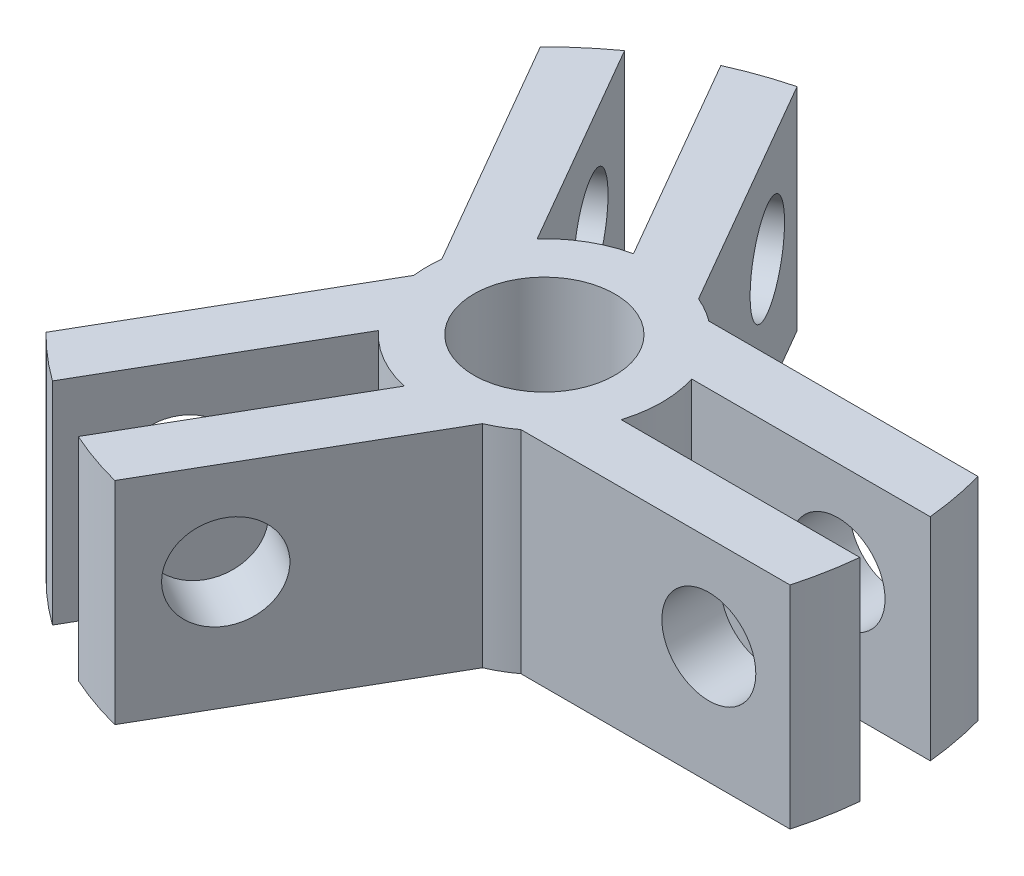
ISO-10303-21;
HEADER;
FILE_DESCRIPTION(('STEP AP214'),'2;1');
FILE_NAME('part.step','',(''),(''),'','','');
FILE_SCHEMA(('AUTOMOTIVE_DESIGN { 1 0 10303 214 1 1 1 1 }'));
ENDSEC;
DATA;
#1=APPLICATION_CONTEXT('core data for automotive mechanical design processes');
#2=APPLICATION_PROTOCOL_DEFINITION('international standard','automotive_design',2000,#1);
#3=PRODUCT_CONTEXT('',#1,'mechanical');
#4=PRODUCT('Part','Part','',(#3));
#5=PRODUCT_RELATED_PRODUCT_CATEGORY('part','',(#4));
#6=PRODUCT_DEFINITION_FORMATION('','',#4);
#7=PRODUCT_DEFINITION_CONTEXT('part definition',#1,'design');
#8=PRODUCT_DEFINITION('design','',#6,#7);
#9=PRODUCT_DEFINITION_SHAPE('','',#8);
#10=(LENGTH_UNIT() NAMED_UNIT(*) SI_UNIT(.MILLI.,.METRE.));
#11=(NAMED_UNIT(*) PLANE_ANGLE_UNIT() SI_UNIT($,.RADIAN.));
#12=(NAMED_UNIT(*) SI_UNIT($,.STERADIAN.) SOLID_ANGLE_UNIT());
#13=UNCERTAINTY_MEASURE_WITH_UNIT(LENGTH_MEASURE(1.E-05),#10,'distance_accuracy_value','');
#14=(GEOMETRIC_REPRESENTATION_CONTEXT(3) GLOBAL_UNCERTAINTY_ASSIGNED_CONTEXT((#13)) GLOBAL_UNIT_ASSIGNED_CONTEXT((#10,
#11,#12)) REPRESENTATION_CONTEXT('',''));
#15=CARTESIAN_POINT('',(0.,0.,0.));
#16=DIRECTION('',(0.,0.,1.));
#17=DIRECTION('',(1.,0.,0.));
#18=AXIS2_PLACEMENT_3D('',#15,#16,#17);
#19=CARTESIAN_POINT('',(0.,18.,0.));
#20=DIRECTION('',(0.,-1.,0.));
#21=DIRECTION('',(0.,0.,-1.));
#22=AXIS2_PLACEMENT_3D('',#19,#20,#21);
#23=CYLINDRICAL_SURFACE('',#22,30.);
#24=CARTESIAN_POINT('',(0.,18.,0.));
#25=DIRECTION('',(0.,1.,0.));
#26=DIRECTION('',(0.,0.,1.));
#27=AXIS2_PLACEMENT_3D('',#24,#25,#26);
#28=CIRCLE('',#27,30.);
#29=CARTESIAN_POINT('',(-7.52862906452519,18.,-29.0399680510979));
#30=VERTEX_POINT('',#29);
#31=CARTESIAN_POINT('',(-12.3267353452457,18.,-27.3505319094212));
#32=VERTEX_POINT('',#31);
#33=EDGE_CURVE('E46',#30,#32,#28,.T.);
#34=ORIENTED_EDGE('',*,*,#33,.F.);
#35=DIRECTION('',(0.,1.,0.));
#36=VECTOR('',#35,1.);
#37=CARTESIAN_POINT('',(-7.52862906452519,0.,-29.0399680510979));
#38=LINE('',#37,#36);
#39=CARTESIAN_POINT('',(-7.52862906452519,0.,-29.0399680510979));
#40=VERTEX_POINT('',#39);
#41=EDGE_CURVE('E236',#40,#30,#38,.T.);
#42=ORIENTED_EDGE('',*,*,#41,.F.);
#43=CARTESIAN_POINT('',(0.,0.,0.));
#44=DIRECTION('',(0.,1.,0.));
#45=DIRECTION('',(0.,0.,1.));
#46=AXIS2_PLACEMENT_3D('',#43,#44,#45);
#47=CIRCLE('',#46,30.);
#48=CARTESIAN_POINT('',(-12.3267353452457,0.,-27.3505319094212));
#49=VERTEX_POINT('',#48);
#50=EDGE_CURVE('E377',#40,#49,#47,.T.);
#51=ORIENTED_EDGE('',*,*,#50,.T.);
#52=DIRECTION('',(0.,1.,0.));
#53=VECTOR('',#52,1.);
#54=CARTESIAN_POINT('',(-12.3267353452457,0.,-27.3505319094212));
#55=LINE('',#54,#53);
#56=EDGE_CURVE('E306',#49,#32,#55,.T.);
#57=ORIENTED_EDGE('',*,*,#56,.T.);
#58=EDGE_LOOP('',(#34,#42,#51,#57));
#59=FACE_BOUND('',#58,.T.);
#60=ADVANCED_FACE('F37',(#59),#23,.T.);
#61=CARTESIAN_POINT('',(-21.3850355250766,18.,21.0399680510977));
#62=VERTEX_POINT('',#61);
#63=CARTESIAN_POINT('',(-17.5228877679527,18.,24.3505319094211));
#64=VERTEX_POINT('',#63);
#65=EDGE_CURVE('E484',#62,#64,#28,.T.);
#66=ORIENTED_EDGE('',*,*,#65,.F.);
#67=DIRECTION('',(0.,1.,0.));
#68=VECTOR('',#67,1.);
#69=CARTESIAN_POINT('',(-21.3850355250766,0.,21.0399680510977));
#70=LINE('',#69,#68);
#71=CARTESIAN_POINT('',(-21.3850355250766,0.,21.0399680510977));
#72=VERTEX_POINT('',#71);
#73=EDGE_CURVE('E258',#72,#62,#70,.T.);
#74=ORIENTED_EDGE('',*,*,#73,.F.);
#75=CARTESIAN_POINT('',(-17.5228877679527,0.,24.3505319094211));
#76=VERTEX_POINT('',#75);
#77=EDGE_CURVE('E461',#72,#76,#47,.T.);
#78=ORIENTED_EDGE('',*,*,#77,.T.);
#79=DIRECTION('',(0.,1.,0.));
#80=VECTOR('',#79,1.);
#81=CARTESIAN_POINT('',(-17.5228877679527,0.,24.3505319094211));
#82=LINE('',#81,#80);
#83=EDGE_CURVE('E333',#76,#64,#82,.T.);
#84=ORIENTED_EDGE('',*,*,#83,.T.);
#85=EDGE_LOOP('',(#66,#74,#78,#84));
#86=FACE_BOUND('',#85,.T.);
#87=ADVANCED_FACE('F437',(#86),#23,.T.);
#88=CARTESIAN_POINT('',(28.9136645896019,18.,7.99999999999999));
#89=VERTEX_POINT('',#88);
#90=CARTESIAN_POINT('',(29.8496231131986,18.,2.99999999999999));
#91=VERTEX_POINT('',#90);
#92=EDGE_CURVE('E376',#89,#91,#28,.T.);
#93=ORIENTED_EDGE('',*,*,#92,.F.);
#94=DIRECTION('',(0.,1.,0.));
#95=VECTOR('',#94,1.);
#96=CARTESIAN_POINT('',(28.9136645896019,0.,7.99999999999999));
#97=LINE('',#96,#95);
#98=CARTESIAN_POINT('',(28.9136645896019,0.,7.99999999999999));
#99=VERTEX_POINT('',#98);
#100=EDGE_CURVE('E282',#99,#89,#97,.T.);
#101=ORIENTED_EDGE('',*,*,#100,.F.);
#102=CARTESIAN_POINT('',(29.8496231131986,0.,2.99999999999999));
#103=VERTEX_POINT('',#102);
#104=EDGE_CURVE('E374',#99,#103,#47,.T.);
#105=ORIENTED_EDGE('',*,*,#104,.T.);
#106=DIRECTION('',(0.,1.,0.));
#107=VECTOR('',#106,1.);
#108=CARTESIAN_POINT('',(29.8496231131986,0.,2.99999999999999));
#109=LINE('',#108,#107);
#110=EDGE_CURVE('E360',#103,#91,#109,.T.);
#111=ORIENTED_EDGE('',*,*,#110,.T.);
#112=EDGE_LOOP('',(#93,#101,#105,#111));
#113=FACE_BOUND('',#112,.T.);
#114=ADVANCED_FACE('F442',(#113),#23,.T.);
#115=CARTESIAN_POINT('',(29.8496231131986,0.,-3.00000000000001));
#116=VERTEX_POINT('',#115);
#117=CARTESIAN_POINT('',(28.913664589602,0.,-7.99999999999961));
#118=VERTEX_POINT('',#117);
#119=EDGE_CURVE('E375',#116,#118,#47,.T.);
#120=ORIENTED_EDGE('',*,*,#119,.T.);
#121=DIRECTION('',(0.,1.,0.));
#122=VECTOR('',#121,1.);
#123=CARTESIAN_POINT('',(28.913664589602,0.,-7.99999999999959));
#124=LINE('',#123,#122);
#125=CARTESIAN_POINT('',(28.913664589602,18.,-7.99999999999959));
#126=VERTEX_POINT('',#125);
#127=EDGE_CURVE('E55',#118,#126,#124,.T.);
#128=ORIENTED_EDGE('',*,*,#127,.T.);
#129=CARTESIAN_POINT('',(29.8496231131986,18.,-3.00000000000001));
#130=VERTEX_POINT('',#129);
#131=EDGE_CURVE('E11',#130,#126,#28,.T.);
#132=ORIENTED_EDGE('',*,*,#131,.F.);
#133=DIRECTION('',(0.,1.,0.));
#134=VECTOR('',#133,1.);
#135=CARTESIAN_POINT('',(29.8496231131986,0.,-3.00000000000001));
#136=LINE('',#135,#134);
#137=EDGE_CURVE('E352',#116,#130,#136,.T.);
#138=ORIENTED_EDGE('',*,*,#137,.F.);
#139=EDGE_LOOP('',(#120,#128,#132,#138));
#140=FACE_BOUND('',#139,.T.);
#141=ADVANCED_FACE('F454',(#140),#23,.T.);
#142=CARTESIAN_POINT('',(-17.5228877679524,0.,-24.3505319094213));
#143=VERTEX_POINT('',#142);
#144=CARTESIAN_POINT('',(-21.3850355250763,0.,-21.039968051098));
#145=VERTEX_POINT('',#144);
#146=EDGE_CURVE('E462',#143,#145,#47,.T.);
#147=ORIENTED_EDGE('',*,*,#146,.T.);
#148=DIRECTION('',(0.,1.,0.));
#149=VECTOR('',#148,1.);
#150=CARTESIAN_POINT('',(-21.3850355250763,0.,-21.039968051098));
#151=LINE('',#150,#149);
#152=CARTESIAN_POINT('',(-21.3850355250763,18.,-21.039968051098));
#153=VERTEX_POINT('',#152);
#154=EDGE_CURVE('E63',#145,#153,#151,.T.);
#155=ORIENTED_EDGE('',*,*,#154,.T.);
#156=CARTESIAN_POINT('',(-17.5228877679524,18.,-24.3505319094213));
#157=VERTEX_POINT('',#156);
#158=EDGE_CURVE('E483',#157,#153,#28,.T.);
#159=ORIENTED_EDGE('',*,*,#158,.F.);
#160=DIRECTION('',(0.,1.,0.));
#161=VECTOR('',#160,1.);
#162=CARTESIAN_POINT('',(-17.5228877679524,0.,-24.3505319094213));
#163=LINE('',#162,#161);
#164=EDGE_CURVE('E298',#143,#157,#163,.T.);
#165=ORIENTED_EDGE('',*,*,#164,.F.);
#166=EDGE_LOOP('',(#147,#155,#159,#165));
#167=FACE_BOUND('',#166,.T.);
#168=ADVANCED_FACE('F447',(#167),#23,.T.);
#169=CARTESIAN_POINT('',(-12.3267353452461,0.,27.3505319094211));
#170=VERTEX_POINT('',#169);
#171=CARTESIAN_POINT('',(-7.52862906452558,0.,29.0399680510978));
#172=VERTEX_POINT('',#171);
#173=EDGE_CURVE('E378',#170,#172,#47,.T.);
#174=ORIENTED_EDGE('',*,*,#173,.T.);
#175=DIRECTION('',(0.,1.,0.));
#176=VECTOR('',#175,1.);
#177=CARTESIAN_POINT('',(-7.52862906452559,0.,29.0399680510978));
#178=LINE('',#177,#176);
#179=CARTESIAN_POINT('',(-7.52862906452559,18.,29.0399680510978));
#180=VERTEX_POINT('',#179);
#181=EDGE_CURVE('E284',#172,#180,#178,.T.);
#182=ORIENTED_EDGE('',*,*,#181,.T.);
#183=CARTESIAN_POINT('',(-12.3267353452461,18.,27.3505319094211));
#184=VERTEX_POINT('',#183);
#185=EDGE_CURVE('E48',#184,#180,#28,.T.);
#186=ORIENTED_EDGE('',*,*,#185,.F.);
#187=DIRECTION('',(0.,1.,0.));
#188=VECTOR('',#187,1.);
#189=CARTESIAN_POINT('',(-12.3267353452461,0.,27.3505319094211));
#190=LINE('',#189,#188);
#191=EDGE_CURVE('E325',#170,#184,#190,.T.);
#192=ORIENTED_EDGE('',*,*,#191,.F.);
#193=EDGE_LOOP('',(#174,#182,#186,#192));
#194=FACE_BOUND('',#193,.T.);
#195=ADVANCED_FACE('F39',(#194),#23,.T.);
#196=CARTESIAN_POINT('',(0.,18.,0.));
#197=DIRECTION('',(0.,1.,0.));
#198=DIRECTION('',(0.,0.,1.));
#199=AXIS2_PLACEMENT_3D('',#196,#197,#198);
#200=PLANE('',#199);
#201=DIRECTION('',(0.499999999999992,0.,0.866025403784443));
#202=VECTOR('',#201,1.);
#203=CARTESIAN_POINT('',(3.92820323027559,18.,-9.19615242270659));
#204=LINE('',#203,#202);
#205=CARTESIAN_POINT('',(3.92820323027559,18.,-9.19615242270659));
#206=VERTEX_POINT('',#205);
#207=EDGE_CURVE('E221',#30,#206,#204,.T.);
#208=ORIENTED_EDGE('',*,*,#207,.F.);
#209=ORIENTED_EDGE('',*,*,#33,.T.);
#210=DIRECTION('',(-0.499999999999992,0.,-0.866025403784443));
#211=VECTOR('',#210,1.);
#212=CARTESIAN_POINT('',(-2.17161979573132,18.,-9.76135582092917));
#213=LINE('',#212,#211);
#214=CARTESIAN_POINT('',(-2.17161979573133,18.,-9.76135582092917));
#215=VERTEX_POINT('',#214);
#216=EDGE_CURVE('E292',#215,#32,#213,.T.);
#217=ORIENTED_EDGE('',*,*,#216,.F.);
#218=CARTESIAN_POINT('',(0.,18.,0.));
#219=DIRECTION('',(0.,-1.,0.));
#220=DIRECTION('',(-0.866025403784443,0.,0.499999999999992));
#221=AXIS2_PLACEMENT_3D('',#218,#219,#220);
#222=CIRCLE('',#221,10.);
#223=CARTESIAN_POINT('',(-7.36777221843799,18.,-6.76135582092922));
#224=VERTEX_POINT('',#223);
#225=EDGE_CURVE('E301',#224,#215,#222,.T.);
#226=ORIENTED_EDGE('',*,*,#225,.F.);
#227=DIRECTION('',(0.499999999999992,0.,0.866025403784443));
#228=VECTOR('',#227,1.);
#229=CARTESIAN_POINT('',(-17.5228877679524,18.,-24.3505319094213));
#230=LINE('',#229,#228);
#231=EDGE_CURVE('E281',#157,#224,#230,.T.);
#232=ORIENTED_EDGE('',*,*,#231,.F.);
#233=ORIENTED_EDGE('',*,*,#158,.T.);
#234=DIRECTION('',(-0.499999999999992,0.,-0.866025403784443));
#235=VECTOR('',#234,1.);
#236=CARTESIAN_POINT('',(-21.3850355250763,18.,-21.039968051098));
#237=LINE('',#236,#235);
#238=CARTESIAN_POINT('',(-9.9282032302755,18.,-1.19615242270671));
#239=VERTEX_POINT('',#238);
#240=EDGE_CURVE('E251',#239,#153,#237,.T.);
#241=ORIENTED_EDGE('',*,*,#240,.F.);
#242=CARTESIAN_POINT('',(0.,18.,0.));
#243=DIRECTION('',(0.,-1.,0.));
#244=DIRECTION('',(-0.866025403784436,0.,-0.500000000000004));
#245=AXIS2_PLACEMENT_3D('',#242,#243,#244);
#246=CIRCLE('',#245,10.);
#247=CARTESIAN_POINT('',(-9.92820323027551,18.,1.19615242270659));
#248=VERTEX_POINT('',#247);
#249=EDGE_CURVE('E235',#248,#239,#246,.T.);
#250=ORIENTED_EDGE('',*,*,#249,.F.);
#251=DIRECTION('',(0.500000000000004,0.,-0.866025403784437));
#252=VECTOR('',#251,1.);
#253=CARTESIAN_POINT('',(-9.92820323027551,18.,1.19615242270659));
#254=LINE('',#253,#252);
#255=EDGE_CURVE('E243',#62,#248,#254,.T.);
#256=ORIENTED_EDGE('',*,*,#255,.F.);
#257=ORIENTED_EDGE('',*,*,#65,.T.);
#258=DIRECTION('',(-0.500000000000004,0.,0.866025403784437));
#259=VECTOR('',#258,1.);
#260=CARTESIAN_POINT('',(-7.36777221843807,18.,6.76135582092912));
#261=LINE('',#260,#259);
#262=CARTESIAN_POINT('',(-7.36777221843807,18.,6.76135582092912));
#263=VERTEX_POINT('',#262);
#264=EDGE_CURVE('E319',#263,#64,#261,.T.);
#265=ORIENTED_EDGE('',*,*,#264,.F.);
#266=CARTESIAN_POINT('',(0.,18.,0.));
#267=DIRECTION('',(0.,-1.,0.));
#268=DIRECTION('',(0.866025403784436,0.,0.500000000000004));
#269=AXIS2_PLACEMENT_3D('',#266,#267,#268);
#270=CIRCLE('',#269,10.);
#271=CARTESIAN_POINT('',(-2.17161979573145,18.,9.76135582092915));
#272=VERTEX_POINT('',#271);
#273=EDGE_CURVE('E328',#272,#263,#270,.T.);
#274=ORIENTED_EDGE('',*,*,#273,.F.);
#275=DIRECTION('',(0.500000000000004,0.,-0.866025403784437));
#276=VECTOR('',#275,1.);
#277=CARTESIAN_POINT('',(-12.3267353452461,18.,27.3505319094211));
#278=LINE('',#277,#276);
#279=EDGE_CURVE('E309',#184,#272,#278,.T.);
#280=ORIENTED_EDGE('',*,*,#279,.F.);
#281=ORIENTED_EDGE('',*,*,#185,.T.);
#282=DIRECTION('',(-0.500000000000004,0.,0.866025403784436));
#283=VECTOR('',#282,1.);
#284=CARTESIAN_POINT('',(-7.52862906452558,18.,29.0399680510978));
#285=LINE('',#284,#283);
#286=CARTESIAN_POINT('',(3.92820323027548,18.,9.19615242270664));
#287=VERTEX_POINT('',#286);
#288=EDGE_CURVE('E275',#287,#180,#285,.T.);
#289=ORIENTED_EDGE('',*,*,#288,.F.);
#290=CARTESIAN_POINT('',(0.,18.,0.));
#291=DIRECTION('',(0.,-1.,0.));
#292=DIRECTION('',(0.,0.,1.));
#293=AXIS2_PLACEMENT_3D('',#290,#291,#292);
#294=CIRCLE('',#293,10.);
#295=CARTESIAN_POINT('',(6.,18.,8.));
#296=VERTEX_POINT('',#295);
#297=EDGE_CURVE('E257',#296,#287,#294,.T.);
#298=ORIENTED_EDGE('',*,*,#297,.F.);
#299=DIRECTION('',(-1.,0.,0.));
#300=VECTOR('',#299,1.);
#301=CARTESIAN_POINT('',(6.,18.,8.));
#302=LINE('',#301,#300);
#303=EDGE_CURVE('E266',#89,#296,#302,.T.);
#304=ORIENTED_EDGE('',*,*,#303,.F.);
#305=ORIENTED_EDGE('',*,*,#92,.T.);
#306=DIRECTION('',(1.,0.,0.));
#307=VECTOR('',#306,1.);
#308=CARTESIAN_POINT('',(9.53939201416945,18.,3.));
#309=LINE('',#308,#307);
#310=CARTESIAN_POINT('',(9.53939201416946,18.,3.));
#311=VERTEX_POINT('',#310);
#312=EDGE_CURVE('E346',#311,#91,#309,.T.);
#313=ORIENTED_EDGE('',*,*,#312,.F.);
#314=CARTESIAN_POINT('',(0.,18.,0.));
#315=DIRECTION('',(0.,-1.,0.));
#316=DIRECTION('',(0.,0.,-1.));
#317=AXIS2_PLACEMENT_3D('',#314,#315,#316);
#318=CIRCLE('',#317,10.);
#319=CARTESIAN_POINT('',(9.53939201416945,18.,-3.00000000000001));
#320=VERTEX_POINT('',#319);
#321=EDGE_CURVE('E355',#320,#311,#318,.T.);
#322=ORIENTED_EDGE('',*,*,#321,.F.);
#323=DIRECTION('',(-1.,0.,0.));
#324=VECTOR('',#323,1.);
#325=CARTESIAN_POINT('',(29.8496231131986,18.,-3.00000000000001));
#326=LINE('',#325,#324);
#327=EDGE_CURVE('E336',#130,#320,#326,.T.);
#328=ORIENTED_EDGE('',*,*,#327,.F.);
#329=ORIENTED_EDGE('',*,*,#131,.T.);
#330=DIRECTION('',(1.,0.,0.));
#331=VECTOR('',#330,1.);
#332=CARTESIAN_POINT('',(28.913664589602,18.,-7.99999999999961));
#333=LINE('',#332,#331);
#334=CARTESIAN_POINT('',(6.0000000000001,18.,-7.99999999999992));
#335=VERTEX_POINT('',#334);
#336=EDGE_CURVE('E224',#335,#126,#333,.T.);
#337=ORIENTED_EDGE('',*,*,#336,.F.);
#338=CARTESIAN_POINT('',(0.,18.,0.));
#339=DIRECTION('',(0.,-1.,0.));
#340=DIRECTION('',(0.866025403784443,0.,-0.499999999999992));
#341=AXIS2_PLACEMENT_3D('',#338,#339,#340);
#342=CIRCLE('',#341,10.);
#343=EDGE_CURVE('E209',#206,#335,#342,.T.);
#344=ORIENTED_EDGE('',*,*,#343,.F.);
#345=EDGE_LOOP('',(#208,#209,#217,#226,#232,#233,#241,#250,#256,#257,#265,#274,#280,#281,#289,
#298,#304,#305,#313,#322,#328,#329,#337,#344));
#346=FACE_BOUND('',#345,.T.);
#347=CARTESIAN_POINT('',(0.,18.,0.));
#348=DIRECTION('',(0.,1.,0.));
#349=DIRECTION('',(0.,0.,1.));
#350=AXIS2_PLACEMENT_3D('',#347,#348,#349);
#351=CIRCLE('',#350,6.);
#352=CARTESIAN_POINT('',(0.,18.,6.));
#353=VERTEX_POINT('',#352);
#354=EDGE_CURVE('E371',#353,#353,#351,.T.);
#355=ORIENTED_EDGE('',*,*,#354,.F.);
#356=EDGE_LOOP('',(#355));
#357=FACE_BOUND('',#356,.T.);
#358=ADVANCED_FACE('F446',(#346,#357),#200,.T.);
#359=CARTESIAN_POINT('',(0.,0.,0.));
#360=DIRECTION('',(0.,1.,0.));
#361=DIRECTION('',(0.,0.,1.));
#362=AXIS2_PLACEMENT_3D('',#359,#360,#361);
#363=PLANE('',#362);
#364=CARTESIAN_POINT('',(0.,0.,0.));
#365=DIRECTION('',(0.,1.,0.));
#366=DIRECTION('',(0.,0.,1.));
#367=AXIS2_PLACEMENT_3D('',#364,#365,#366);
#368=CIRCLE('',#367,6.);
#369=CARTESIAN_POINT('',(0.,0.,6.));
#370=VERTEX_POINT('',#369);
#371=EDGE_CURVE('E363',#370,#370,#368,.T.);
#372=ORIENTED_EDGE('',*,*,#371,.T.);
#373=EDGE_LOOP('',(#372));
#374=FACE_BOUND('',#373,.T.);
#375=ORIENTED_EDGE('',*,*,#50,.F.);
#376=DIRECTION('',(0.499999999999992,0.,0.866025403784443));
#377=VECTOR('',#376,1.);
#378=CARTESIAN_POINT('',(3.92820323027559,0.,-9.19615242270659));
#379=LINE('',#378,#377);
#380=CARTESIAN_POINT('',(3.92820323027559,0.,-9.19615242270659));
#381=VERTEX_POINT('',#380);
#382=EDGE_CURVE('E211',#40,#381,#379,.T.);
#383=ORIENTED_EDGE('',*,*,#382,.T.);
#384=CARTESIAN_POINT('',(0.,0.,0.));
#385=DIRECTION('',(0.,-1.,0.));
#386=DIRECTION('',(0.866025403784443,0.,-0.499999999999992));
#387=AXIS2_PLACEMENT_3D('',#384,#385,#386);
#388=CIRCLE('',#387,10.);
#389=CARTESIAN_POINT('',(6.0000000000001,0.,-7.99999999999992));
#390=VERTEX_POINT('',#389);
#391=EDGE_CURVE('E206',#381,#390,#388,.T.);
#392=ORIENTED_EDGE('',*,*,#391,.T.);
#393=DIRECTION('',(1.,0.,0.));
#394=VECTOR('',#393,1.);
#395=CARTESIAN_POINT('',(28.913664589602,0.,-7.99999999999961));
#396=LINE('',#395,#394);
#397=EDGE_CURVE('E213',#390,#118,#396,.T.);
#398=ORIENTED_EDGE('',*,*,#397,.T.);
#399=ORIENTED_EDGE('',*,*,#119,.F.);
#400=DIRECTION('',(-1.,0.,0.));
#401=VECTOR('',#400,1.);
#402=CARTESIAN_POINT('',(29.8496231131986,0.,-3.00000000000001));
#403=LINE('',#402,#401);
#404=CARTESIAN_POINT('',(9.53939201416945,0.,-3.00000000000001));
#405=VERTEX_POINT('',#404);
#406=EDGE_CURVE('E342',#116,#405,#403,.T.);
#407=ORIENTED_EDGE('',*,*,#406,.T.);
#408=CARTESIAN_POINT('',(0.,0.,0.));
#409=DIRECTION('',(0.,-1.,0.));
#410=DIRECTION('',(0.,0.,-1.));
#411=AXIS2_PLACEMENT_3D('',#408,#409,#410);
#412=CIRCLE('',#411,10.);
#413=CARTESIAN_POINT('',(9.53939201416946,0.,3.));
#414=VERTEX_POINT('',#413);
#415=EDGE_CURVE('E345',#405,#414,#412,.T.);
#416=ORIENTED_EDGE('',*,*,#415,.T.);
#417=DIRECTION('',(1.,0.,0.));
#418=VECTOR('',#417,1.);
#419=CARTESIAN_POINT('',(9.53939201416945,0.,3.));
#420=LINE('',#419,#418);
#421=EDGE_CURVE('E349',#414,#103,#420,.T.);
#422=ORIENTED_EDGE('',*,*,#421,.T.);
#423=ORIENTED_EDGE('',*,*,#104,.F.);
#424=DIRECTION('',(-1.,0.,0.));
#425=VECTOR('',#424,1.);
#426=CARTESIAN_POINT('',(6.,0.,8.));
#427=LINE('',#426,#425);
#428=CARTESIAN_POINT('',(6.,0.,8.));
#429=VERTEX_POINT('',#428);
#430=EDGE_CURVE('E269',#99,#429,#427,.T.);
#431=ORIENTED_EDGE('',*,*,#430,.T.);
#432=CARTESIAN_POINT('',(0.,0.,0.));
#433=DIRECTION('',(0.,-1.,0.));
#434=DIRECTION('',(0.,0.,1.));
#435=AXIS2_PLACEMENT_3D('',#432,#433,#434);
#436=CIRCLE('',#435,10.);
#437=CARTESIAN_POINT('',(3.92820323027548,0.,9.19615242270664));
#438=VERTEX_POINT('',#437);
#439=EDGE_CURVE('E262',#429,#438,#436,.T.);
#440=ORIENTED_EDGE('',*,*,#439,.T.);
#441=DIRECTION('',(-0.500000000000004,0.,0.866025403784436));
#442=VECTOR('',#441,1.);
#443=CARTESIAN_POINT('',(-7.52862906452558,0.,29.0399680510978));
#444=LINE('',#443,#442);
#445=EDGE_CURVE('E265',#438,#172,#444,.T.);
#446=ORIENTED_EDGE('',*,*,#445,.T.);
#447=ORIENTED_EDGE('',*,*,#173,.F.);
#448=DIRECTION('',(0.500000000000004,0.,-0.866025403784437));
#449=VECTOR('',#448,1.);
#450=CARTESIAN_POINT('',(-12.3267353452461,0.,27.3505319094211));
#451=LINE('',#450,#449);
#452=CARTESIAN_POINT('',(-2.17161979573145,0.,9.76135582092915));
#453=VERTEX_POINT('',#452);
#454=EDGE_CURVE('E315',#170,#453,#451,.T.);
#455=ORIENTED_EDGE('',*,*,#454,.T.);
#456=CARTESIAN_POINT('',(0.,0.,0.));
#457=DIRECTION('',(0.,-1.,0.));
#458=DIRECTION('',(0.866025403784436,0.,0.500000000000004));
#459=AXIS2_PLACEMENT_3D('',#456,#457,#458);
#460=CIRCLE('',#459,10.);
#461=CARTESIAN_POINT('',(-7.36777221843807,0.,6.76135582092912));
#462=VERTEX_POINT('',#461);
#463=EDGE_CURVE('E318',#453,#462,#460,.T.);
#464=ORIENTED_EDGE('',*,*,#463,.T.);
#465=DIRECTION('',(-0.500000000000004,0.,0.866025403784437));
#466=VECTOR('',#465,1.);
#467=CARTESIAN_POINT('',(-7.36777221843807,0.,6.76135582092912));
#468=LINE('',#467,#466);
#469=EDGE_CURVE('E322',#462,#76,#468,.T.);
#470=ORIENTED_EDGE('',*,*,#469,.T.);
#471=ORIENTED_EDGE('',*,*,#77,.F.);
#472=DIRECTION('',(0.500000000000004,0.,-0.866025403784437));
#473=VECTOR('',#472,1.);
#474=CARTESIAN_POINT('',(-9.92820323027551,0.,1.19615242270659));
#475=LINE('',#474,#473);
#476=CARTESIAN_POINT('',(-9.92820323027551,0.,1.19615242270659));
#477=VERTEX_POINT('',#476);
#478=EDGE_CURVE('E245',#72,#477,#475,.T.);
#479=ORIENTED_EDGE('',*,*,#478,.T.);
#480=CARTESIAN_POINT('',(0.,0.,0.));
#481=DIRECTION('',(0.,-1.,0.));
#482=DIRECTION('',(-0.866025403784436,0.,-0.500000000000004));
#483=AXIS2_PLACEMENT_3D('',#480,#481,#482);
#484=CIRCLE('',#483,10.);
#485=CARTESIAN_POINT('',(-9.9282032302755,0.,-1.19615242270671));
#486=VERTEX_POINT('',#485);
#487=EDGE_CURVE('E239',#477,#486,#484,.T.);
#488=ORIENTED_EDGE('',*,*,#487,.T.);
#489=DIRECTION('',(-0.499999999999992,0.,-0.866025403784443));
#490=VECTOR('',#489,1.);
#491=CARTESIAN_POINT('',(-21.3850355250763,0.,-21.039968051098));
#492=LINE('',#491,#490);
#493=EDGE_CURVE('E242',#486,#145,#492,.T.);
#494=ORIENTED_EDGE('',*,*,#493,.T.);
#495=ORIENTED_EDGE('',*,*,#146,.F.);
#496=DIRECTION('',(0.499999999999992,0.,0.866025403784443));
#497=VECTOR('',#496,1.);
#498=CARTESIAN_POINT('',(-17.5228877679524,0.,-24.3505319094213));
#499=LINE('',#498,#497);
#500=CARTESIAN_POINT('',(-7.36777221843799,0.,-6.76135582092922));
#501=VERTEX_POINT('',#500);
#502=EDGE_CURVE('E288',#143,#501,#499,.T.);
#503=ORIENTED_EDGE('',*,*,#502,.T.);
#504=CARTESIAN_POINT('',(0.,0.,0.));
#505=DIRECTION('',(0.,-1.,0.));
#506=DIRECTION('',(-0.866025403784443,0.,0.499999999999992));
#507=AXIS2_PLACEMENT_3D('',#504,#505,#506);
#508=CIRCLE('',#507,10.);
#509=CARTESIAN_POINT('',(-2.17161979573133,0.,-9.76135582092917));
#510=VERTEX_POINT('',#509);
#511=EDGE_CURVE('E291',#501,#510,#508,.T.);
#512=ORIENTED_EDGE('',*,*,#511,.T.);
#513=DIRECTION('',(-0.499999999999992,0.,-0.866025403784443));
#514=VECTOR('',#513,1.);
#515=CARTESIAN_POINT('',(-2.17161979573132,0.,-9.76135582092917));
#516=LINE('',#515,#514);
#517=EDGE_CURVE('E295',#510,#49,#516,.T.);
#518=ORIENTED_EDGE('',*,*,#517,.T.);
#519=EDGE_LOOP('',(#375,#383,#392,#398,#399,#407,#416,#422,#423,#431,#440,#446,#447,#455,#464,
#470,#471,#479,#488,#494,#495,#503,#512,#518));
#520=FACE_BOUND('',#519,.T.);
#521=ADVANCED_FACE('F220',(#374,#520),#363,.F.);
#522=CARTESIAN_POINT('',(0.,18.,0.));
#523=DIRECTION('',(0.,1.,0.));
#524=DIRECTION('',(0.,0.,1.));
#525=AXIS2_PLACEMENT_3D('',#522,#523,#524);
#526=CYLINDRICAL_SURFACE('',#525,6.);
#527=ORIENTED_EDGE('',*,*,#371,.F.);
#528=EDGE_LOOP('',(#527));
#529=FACE_BOUND('',#528,.T.);
#530=ORIENTED_EDGE('',*,*,#354,.T.);
#531=EDGE_LOOP('',(#530));
#532=FACE_BOUND('',#531,.T.);
#533=ADVANCED_FACE('F550',(#529,#532),#526,.F.);
#534=CARTESIAN_POINT('',(9.53939201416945,0.,3.));
#535=DIRECTION('',(0.,0.,1.));
#536=DIRECTION('',(1.,0.,0.));
#537=AXIS2_PLACEMENT_3D('',#534,#535,#536);
#538=PLANE('',#537);
#539=CARTESIAN_POINT('',(22.,10.,3.));
#540=DIRECTION('',(0.,0.,1.));
#541=DIRECTION('',(1.,0.,0.));
#542=AXIS2_PLACEMENT_3D('',#539,#540,#541);
#543=CIRCLE('',#542,4.);
#544=CARTESIAN_POINT('',(26.,10.,2.99999999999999));
#545=VERTEX_POINT('',#544);
#546=EDGE_CURVE('E227',#545,#545,#543,.T.);
#547=ORIENTED_EDGE('',*,*,#546,.T.);
#548=EDGE_LOOP('',(#547));
#549=FACE_BOUND('',#548,.T.);
#550=ORIENTED_EDGE('',*,*,#312,.T.);
#551=ORIENTED_EDGE('',*,*,#110,.F.);
#552=ORIENTED_EDGE('',*,*,#421,.F.);
#553=DIRECTION('',(0.,1.,0.));
#554=VECTOR('',#553,1.);
#555=CARTESIAN_POINT('',(9.53939201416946,0.,3.));
#556=LINE('',#555,#554);
#557=EDGE_CURVE('E364',#414,#311,#556,.T.);
#558=ORIENTED_EDGE('',*,*,#557,.T.);
#559=EDGE_LOOP('',(#550,#551,#552,#558));
#560=FACE_BOUND('',#559,.T.);
#561=ADVANCED_FACE('F416',(#549,#560),#538,.F.);
#562=CARTESIAN_POINT('',(0.,0.,0.));
#563=DIRECTION('',(0.,1.,0.));
#564=DIRECTION('',(0.,0.,1.));
#565=AXIS2_PLACEMENT_3D('',#562,#563,#564);
#566=CYLINDRICAL_SURFACE('',#565,10.);
#567=ORIENTED_EDGE('',*,*,#321,.T.);
#568=ORIENTED_EDGE('',*,*,#557,.F.);
#569=ORIENTED_EDGE('',*,*,#415,.F.);
#570=DIRECTION('',(0.,1.,0.));
#571=VECTOR('',#570,1.);
#572=CARTESIAN_POINT('',(9.53939201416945,0.,-3.00000000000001));
#573=LINE('',#572,#571);
#574=EDGE_CURVE('E366',#405,#320,#573,.T.);
#575=ORIENTED_EDGE('',*,*,#574,.T.);
#576=EDGE_LOOP('',(#567,#568,#569,#575));
#577=FACE_BOUND('',#576,.T.);
#578=ADVANCED_FACE('F500',(#577),#566,.T.);
#579=CARTESIAN_POINT('',(29.8496231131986,0.,-3.00000000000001));
#580=DIRECTION('',(0.,0.,-1.));
#581=DIRECTION('',(-1.,0.,0.));
#582=AXIS2_PLACEMENT_3D('',#579,#580,#581);
#583=PLANE('',#582);
#584=CARTESIAN_POINT('',(22.,10.,-3.00000000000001));
#585=DIRECTION('',(0.,0.,-1.));
#586=DIRECTION('',(-1.,0.,0.));
#587=AXIS2_PLACEMENT_3D('',#584,#585,#586);
#588=CIRCLE('',#587,4.);
#589=CARTESIAN_POINT('',(26.,10.,-3.00000000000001));
#590=VERTEX_POINT('',#589);
#591=EDGE_CURVE('E409',#590,#590,#588,.T.);
#592=ORIENTED_EDGE('',*,*,#591,.T.);
#593=EDGE_LOOP('',(#592));
#594=FACE_BOUND('',#593,.T.);
#595=ORIENTED_EDGE('',*,*,#327,.T.);
#596=ORIENTED_EDGE('',*,*,#574,.F.);
#597=ORIENTED_EDGE('',*,*,#406,.F.);
#598=ORIENTED_EDGE('',*,*,#137,.T.);
#599=EDGE_LOOP('',(#595,#596,#597,#598));
#600=FACE_BOUND('',#599,.T.);
#601=ADVANCED_FACE('F502',(#594,#600),#583,.F.);
#602=CARTESIAN_POINT('',(-7.36777221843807,0.,6.76135582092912));
#603=DIRECTION('',(-0.866025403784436,0.,-0.500000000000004));
#604=DIRECTION('',(-0.500000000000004,0.,0.866025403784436));
#605=AXIS2_PLACEMENT_3D('',#602,#603,#604);
#606=PLANE('',#605);
#607=CARTESIAN_POINT('',(-13.5980762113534,10.,17.5525588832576));
#608=DIRECTION('',(-0.866025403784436,0.,-0.500000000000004));
#609=DIRECTION('',(-0.500000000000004,0.,0.866025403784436));
#610=AXIS2_PLACEMENT_3D('',#607,#608,#609);
#611=CIRCLE('',#610,4.);
#612=CARTESIAN_POINT('',(-15.5980762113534,10.,21.0166604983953));
#613=VERTEX_POINT('',#612);
#614=EDGE_CURVE('E383',#613,#613,#611,.T.);
#615=ORIENTED_EDGE('',*,*,#614,.T.);
#616=EDGE_LOOP('',(#615));
#617=FACE_BOUND('',#616,.T.);
#618=ORIENTED_EDGE('',*,*,#264,.T.);
#619=ORIENTED_EDGE('',*,*,#83,.F.);
#620=ORIENTED_EDGE('',*,*,#469,.F.);
#621=DIRECTION('',(0.,1.,0.));
#622=VECTOR('',#621,1.);
#623=CARTESIAN_POINT('',(-7.36777221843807,0.,6.76135582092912));
#624=LINE('',#623,#622);
#625=EDGE_CURVE('E337',#462,#263,#624,.T.);
#626=ORIENTED_EDGE('',*,*,#625,.T.);
#627=EDGE_LOOP('',(#618,#619,#620,#626));
#628=FACE_BOUND('',#627,.T.);
#629=ADVANCED_FACE('F600',(#617,#628),#606,.F.);
#630=CARTESIAN_POINT('',(0.,0.,0.));
#631=DIRECTION('',(0.,1.,0.));
#632=DIRECTION('',(0.,0.,1.));
#633=AXIS2_PLACEMENT_3D('',#630,#631,#632);
#634=CYLINDRICAL_SURFACE('',#633,10.);
#635=ORIENTED_EDGE('',*,*,#273,.T.);
#636=ORIENTED_EDGE('',*,*,#625,.F.);
#637=ORIENTED_EDGE('',*,*,#463,.F.);
#638=DIRECTION('',(0.,1.,0.));
#639=VECTOR('',#638,1.);
#640=CARTESIAN_POINT('',(-2.17161979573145,0.,9.76135582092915));
#641=LINE('',#640,#639);
#642=EDGE_CURVE('E339',#453,#272,#641,.T.);
#643=ORIENTED_EDGE('',*,*,#642,.T.);
#644=EDGE_LOOP('',(#635,#636,#637,#643));
#645=FACE_BOUND('',#644,.T.);
#646=ADVANCED_FACE('F641',(#645),#634,.T.);
#647=CARTESIAN_POINT('',(-12.3267353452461,0.,27.3505319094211));
#648=DIRECTION('',(0.866025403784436,0.,0.500000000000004));
#649=DIRECTION('',(0.500000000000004,0.,-0.866025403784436));
#650=AXIS2_PLACEMENT_3D('',#647,#648,#649);
#651=PLANE('',#650);
#652=CARTESIAN_POINT('',(-8.40192378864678,10.,20.5525588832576));
#653=DIRECTION('',(0.866025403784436,0.,0.500000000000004));
#654=DIRECTION('',(0.500000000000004,0.,-0.866025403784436));
#655=AXIS2_PLACEMENT_3D('',#652,#653,#654);
#656=CIRCLE('',#655,4.);
#657=CARTESIAN_POINT('',(-6.40192378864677,10.,17.0884572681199));
#658=VERTEX_POINT('',#657);
#659=EDGE_CURVE('E403',#658,#658,#656,.T.);
#660=ORIENTED_EDGE('',*,*,#659,.T.);
#661=EDGE_LOOP('',(#660));
#662=FACE_BOUND('',#661,.T.);
#663=ORIENTED_EDGE('',*,*,#279,.T.);
#664=ORIENTED_EDGE('',*,*,#642,.F.);
#665=ORIENTED_EDGE('',*,*,#454,.F.);
#666=ORIENTED_EDGE('',*,*,#191,.T.);
#667=EDGE_LOOP('',(#663,#664,#665,#666));
#668=FACE_BOUND('',#667,.T.);
#669=ADVANCED_FACE('F649',(#662,#668),#651,.F.);
#670=CARTESIAN_POINT('',(-2.17161979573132,0.,-9.76135582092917));
#671=DIRECTION('',(0.866025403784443,0.,-0.499999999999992));
#672=DIRECTION('',(-0.499999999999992,0.,-0.866025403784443));
#673=AXIS2_PLACEMENT_3D('',#670,#671,#672);
#674=PLANE('',#673);
#675=CARTESIAN_POINT('',(-8.4019237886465,10.,-20.5525588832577));
#676=DIRECTION('',(0.866025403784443,0.,-0.499999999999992));
#677=DIRECTION('',(-0.499999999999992,0.,-0.866025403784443));
#678=AXIS2_PLACEMENT_3D('',#675,#676,#677);
#679=CIRCLE('',#678,4.);
#680=CARTESIAN_POINT('',(-10.4019237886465,10.,-24.0166604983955));
#681=VERTEX_POINT('',#680);
#682=EDGE_CURVE('E395',#681,#681,#679,.T.);
#683=ORIENTED_EDGE('',*,*,#682,.T.);
#684=EDGE_LOOP('',(#683));
#685=FACE_BOUND('',#684,.T.);
#686=ORIENTED_EDGE('',*,*,#216,.T.);
#687=ORIENTED_EDGE('',*,*,#56,.F.);
#688=ORIENTED_EDGE('',*,*,#517,.F.);
#689=DIRECTION('',(0.,1.,0.));
#690=VECTOR('',#689,1.);
#691=CARTESIAN_POINT('',(-2.17161979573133,0.,-9.76135582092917));
#692=LINE('',#691,#690);
#693=EDGE_CURVE('E310',#510,#215,#692,.T.);
#694=ORIENTED_EDGE('',*,*,#693,.T.);
#695=EDGE_LOOP('',(#686,#687,#688,#694));
#696=FACE_BOUND('',#695,.T.);
#697=ADVANCED_FACE('F470',(#685,#696),#674,.F.);
#698=CARTESIAN_POINT('',(0.,0.,0.));
#699=DIRECTION('',(0.,1.,0.));
#700=DIRECTION('',(0.,0.,1.));
#701=AXIS2_PLACEMENT_3D('',#698,#699,#700);
#702=CYLINDRICAL_SURFACE('',#701,10.);
#703=ORIENTED_EDGE('',*,*,#225,.T.);
#704=ORIENTED_EDGE('',*,*,#693,.F.);
#705=ORIENTED_EDGE('',*,*,#511,.F.);
#706=DIRECTION('',(0.,1.,0.));
#707=VECTOR('',#706,1.);
#708=CARTESIAN_POINT('',(-7.36777221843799,0.,-6.76135582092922));
#709=LINE('',#708,#707);
#710=EDGE_CURVE('E312',#501,#224,#709,.T.);
#711=ORIENTED_EDGE('',*,*,#710,.T.);
#712=EDGE_LOOP('',(#703,#704,#705,#711));
#713=FACE_BOUND('',#712,.T.);
#714=ADVANCED_FACE('F474',(#713),#702,.T.);
#715=CARTESIAN_POINT('',(-17.5228877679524,0.,-24.3505319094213));
#716=DIRECTION('',(-0.866025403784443,0.,0.499999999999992));
#717=DIRECTION('',(0.499999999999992,0.,0.866025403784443));
#718=AXIS2_PLACEMENT_3D('',#715,#716,#717);
#719=PLANE('',#718);
#720=CARTESIAN_POINT('',(-13.5980762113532,10.,-17.5525588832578));
#721=DIRECTION('',(-0.866025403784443,0.,0.499999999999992));
#722=DIRECTION('',(0.499999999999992,0.,0.866025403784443));
#723=AXIS2_PLACEMENT_3D('',#720,#721,#722);
#724=CIRCLE('',#723,4.);
#725=CARTESIAN_POINT('',(-11.5980762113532,10.,-14.08845726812));
#726=VERTEX_POINT('',#725);
#727=EDGE_CURVE('E390',#726,#726,#724,.T.);
#728=ORIENTED_EDGE('',*,*,#727,.T.);
#729=EDGE_LOOP('',(#728));
#730=FACE_BOUND('',#729,.T.);
#731=ORIENTED_EDGE('',*,*,#231,.T.);
#732=ORIENTED_EDGE('',*,*,#710,.F.);
#733=ORIENTED_EDGE('',*,*,#502,.F.);
#734=ORIENTED_EDGE('',*,*,#164,.T.);
#735=EDGE_LOOP('',(#731,#732,#733,#734));
#736=FACE_BOUND('',#735,.T.);
#737=ADVANCED_FACE('F476',(#730,#736),#719,.F.);
#738=CARTESIAN_POINT('',(0.,0.,0.));
#739=DIRECTION('',(0.,1.,0.));
#740=DIRECTION('',(0.,0.,1.));
#741=AXIS2_PLACEMENT_3D('',#738,#739,#740);
#742=CYLINDRICAL_SURFACE('',#741,10.);
#743=ORIENTED_EDGE('',*,*,#297,.T.);
#744=DIRECTION('',(0.,1.,0.));
#745=VECTOR('',#744,1.);
#746=CARTESIAN_POINT('',(3.92820323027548,0.,9.19615242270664));
#747=LINE('',#746,#745);
#748=EDGE_CURVE('E272',#438,#287,#747,.T.);
#749=ORIENTED_EDGE('',*,*,#748,.F.);
#750=ORIENTED_EDGE('',*,*,#439,.F.);
#751=DIRECTION('',(0.,1.,0.));
#752=VECTOR('',#751,1.);
#753=CARTESIAN_POINT('',(6.,0.,8.));
#754=LINE('',#753,#752);
#755=EDGE_CURVE('E279',#429,#296,#754,.T.);
#756=ORIENTED_EDGE('',*,*,#755,.T.);
#757=EDGE_LOOP('',(#743,#749,#750,#756));
#758=FACE_BOUND('',#757,.T.);
#759=ADVANCED_FACE('F611',(#758),#742,.T.);
#760=CARTESIAN_POINT('',(6.,0.,8.));
#761=DIRECTION('',(0.,0.,-1.));
#762=DIRECTION('',(-1.,0.,0.));
#763=AXIS2_PLACEMENT_3D('',#760,#761,#762);
#764=PLANE('',#763);
#765=CARTESIAN_POINT('',(22.,10.,8.));
#766=DIRECTION('',(0.,0.,-1.));
#767=DIRECTION('',(-1.,0.,0.));
#768=AXIS2_PLACEMENT_3D('',#765,#766,#767);
#769=CIRCLE('',#768,4.);
#770=CARTESIAN_POINT('',(26.,10.,7.99999999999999));
#771=VERTEX_POINT('',#770);
#772=EDGE_CURVE('E382',#771,#771,#769,.T.);
#773=ORIENTED_EDGE('',*,*,#772,.T.);
#774=EDGE_LOOP('',(#773));
#775=FACE_BOUND('',#774,.T.);
#776=ORIENTED_EDGE('',*,*,#303,.T.);
#777=ORIENTED_EDGE('',*,*,#755,.F.);
#778=ORIENTED_EDGE('',*,*,#430,.F.);
#779=ORIENTED_EDGE('',*,*,#100,.T.);
#780=EDGE_LOOP('',(#776,#777,#778,#779));
#781=FACE_BOUND('',#780,.T.);
#782=ADVANCED_FACE('F606',(#775,#781),#764,.F.);
#783=CARTESIAN_POINT('',(-7.52862906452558,0.,29.0399680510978));
#784=DIRECTION('',(-0.866025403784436,0.,-0.500000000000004));
#785=DIRECTION('',(-0.500000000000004,0.,0.866025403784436));
#786=AXIS2_PLACEMENT_3D('',#783,#784,#785);
#787=PLANE('',#786);
#788=CARTESIAN_POINT('',(-4.0717967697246,10.,23.0525588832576));
#789=DIRECTION('',(-0.866025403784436,0.,-0.500000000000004));
#790=DIRECTION('',(-0.500000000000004,0.,0.866025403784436));
#791=AXIS2_PLACEMENT_3D('',#788,#789,#790);
#792=CIRCLE('',#791,4.);
#793=CARTESIAN_POINT('',(-6.07179676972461,10.,26.5166604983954));
#794=VERTEX_POINT('',#793);
#795=EDGE_CURVE('E400',#794,#794,#792,.T.);
#796=ORIENTED_EDGE('',*,*,#795,.T.);
#797=EDGE_LOOP('',(#796));
#798=FACE_BOUND('',#797,.T.);
#799=ORIENTED_EDGE('',*,*,#288,.T.);
#800=ORIENTED_EDGE('',*,*,#181,.F.);
#801=ORIENTED_EDGE('',*,*,#445,.F.);
#802=ORIENTED_EDGE('',*,*,#748,.T.);
#803=EDGE_LOOP('',(#799,#800,#801,#802));
#804=FACE_BOUND('',#803,.T.);
#805=ADVANCED_FACE('F564',(#798,#804),#787,.F.);
#806=CARTESIAN_POINT('',(0.,0.,0.));
#807=DIRECTION('',(0.,1.,0.));
#808=DIRECTION('',(0.,0.,1.));
#809=AXIS2_PLACEMENT_3D('',#806,#807,#808);
#810=CYLINDRICAL_SURFACE('',#809,10.);
#811=ORIENTED_EDGE('',*,*,#249,.T.);
#812=DIRECTION('',(0.,1.,0.));
#813=VECTOR('',#812,1.);
#814=CARTESIAN_POINT('',(-9.9282032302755,0.,-1.19615242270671));
#815=LINE('',#814,#813);
#816=EDGE_CURVE('E248',#486,#239,#815,.T.);
#817=ORIENTED_EDGE('',*,*,#816,.F.);
#818=ORIENTED_EDGE('',*,*,#487,.F.);
#819=DIRECTION('',(0.,1.,0.));
#820=VECTOR('',#819,1.);
#821=CARTESIAN_POINT('',(-9.92820323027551,0.,1.19615242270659));
#822=LINE('',#821,#820);
#823=EDGE_CURVE('E255',#477,#248,#822,.T.);
#824=ORIENTED_EDGE('',*,*,#823,.T.);
#825=EDGE_LOOP('',(#811,#817,#818,#824));
#826=FACE_BOUND('',#825,.T.);
#827=ADVANCED_FACE('F558',(#826),#810,.T.);
#828=CARTESIAN_POINT('',(-9.92820323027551,0.,1.19615242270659));
#829=DIRECTION('',(0.866025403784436,0.,0.500000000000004));
#830=DIRECTION('',(0.500000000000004,0.,-0.866025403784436));
#831=AXIS2_PLACEMENT_3D('',#828,#829,#830);
#832=PLANE('',#831);
#833=CARTESIAN_POINT('',(-17.9282032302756,10.,15.0525588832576));
#834=DIRECTION('',(0.866025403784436,0.,0.500000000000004));
#835=DIRECTION('',(0.500000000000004,0.,-0.866025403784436));
#836=AXIS2_PLACEMENT_3D('',#833,#834,#835);
#837=CIRCLE('',#836,4.);
#838=CARTESIAN_POINT('',(-15.9282032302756,10.,11.5884572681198));
#839=VERTEX_POINT('',#838);
#840=EDGE_CURVE('E41',#839,#839,#837,.T.);
#841=ORIENTED_EDGE('',*,*,#840,.T.);
#842=EDGE_LOOP('',(#841));
#843=FACE_BOUND('',#842,.T.);
#844=ORIENTED_EDGE('',*,*,#255,.T.);
#845=ORIENTED_EDGE('',*,*,#823,.F.);
#846=ORIENTED_EDGE('',*,*,#478,.F.);
#847=ORIENTED_EDGE('',*,*,#73,.T.);
#848=EDGE_LOOP('',(#844,#845,#846,#847));
#849=FACE_BOUND('',#848,.T.);
#850=ADVANCED_FACE('F563',(#843,#849),#832,.F.);
#851=CARTESIAN_POINT('',(-21.3850355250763,0.,-21.039968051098));
#852=DIRECTION('',(0.866025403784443,0.,-0.499999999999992));
#853=DIRECTION('',(-0.499999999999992,0.,-0.866025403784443));
#854=AXIS2_PLACEMENT_3D('',#851,#852,#853);
#855=PLANE('',#854);
#856=CARTESIAN_POINT('',(-17.9282032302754,10.,-15.0525588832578));
#857=DIRECTION('',(0.866025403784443,0.,-0.499999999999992));
#858=DIRECTION('',(-0.499999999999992,0.,-0.866025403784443));
#859=AXIS2_PLACEMENT_3D('',#856,#857,#858);
#860=CIRCLE('',#859,4.);
#861=CARTESIAN_POINT('',(-19.9282032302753,10.,-18.5166604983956));
#862=VERTEX_POINT('',#861);
#863=EDGE_CURVE('E386',#862,#862,#860,.T.);
#864=ORIENTED_EDGE('',*,*,#863,.T.);
#865=EDGE_LOOP('',(#864));
#866=FACE_BOUND('',#865,.T.);
#867=ORIENTED_EDGE('',*,*,#240,.T.);
#868=ORIENTED_EDGE('',*,*,#154,.F.);
#869=ORIENTED_EDGE('',*,*,#493,.F.);
#870=ORIENTED_EDGE('',*,*,#816,.T.);
#871=EDGE_LOOP('',(#867,#868,#869,#870));
#872=FACE_BOUND('',#871,.T.);
#873=ADVANCED_FACE('F578',(#866,#872),#855,.F.);
#874=CARTESIAN_POINT('',(0.,0.,0.));
#875=DIRECTION('',(0.,1.,0.));
#876=DIRECTION('',(0.,0.,1.));
#877=AXIS2_PLACEMENT_3D('',#874,#875,#876);
#878=CYLINDRICAL_SURFACE('',#877,10.);
#879=ORIENTED_EDGE('',*,*,#343,.T.);
#880=DIRECTION('',(0.,1.,0.));
#881=VECTOR('',#880,1.);
#882=CARTESIAN_POINT('',(6.0000000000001,0.,-7.99999999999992));
#883=LINE('',#882,#881);
#884=EDGE_CURVE('E203',#390,#335,#883,.T.);
#885=ORIENTED_EDGE('',*,*,#884,.F.);
#886=ORIENTED_EDGE('',*,*,#391,.F.);
#887=DIRECTION('',(0.,1.,0.));
#888=VECTOR('',#887,1.);
#889=CARTESIAN_POINT('',(3.92820323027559,0.,-9.19615242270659));
#890=LINE('',#889,#888);
#891=EDGE_CURVE('E233',#381,#206,#890,.T.);
#892=ORIENTED_EDGE('',*,*,#891,.T.);
#893=EDGE_LOOP('',(#879,#885,#886,#892));
#894=FACE_BOUND('',#893,.T.);
#895=ADVANCED_FACE('F204',(#894),#878,.T.);
#896=CARTESIAN_POINT('',(3.92820323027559,0.,-9.19615242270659));
#897=DIRECTION('',(-0.866025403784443,0.,0.499999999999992));
#898=DIRECTION('',(0.499999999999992,0.,0.866025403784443));
#899=AXIS2_PLACEMENT_3D('',#896,#897,#898);
#900=PLANE('',#899);
#901=CARTESIAN_POINT('',(-4.07179676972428,10.,-23.0525588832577));
#902=DIRECTION('',(-0.866025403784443,0.,0.499999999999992));
#903=DIRECTION('',(0.499999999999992,0.,0.866025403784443));
#904=AXIS2_PLACEMENT_3D('',#901,#902,#903);
#905=CIRCLE('',#904,4.);
#906=CARTESIAN_POINT('',(-2.07179676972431,10.,-19.5884572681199));
#907=VERTEX_POINT('',#906);
#908=EDGE_CURVE('E384',#907,#907,#905,.T.);
#909=ORIENTED_EDGE('',*,*,#908,.T.);
#910=EDGE_LOOP('',(#909));
#911=FACE_BOUND('',#910,.T.);
#912=ORIENTED_EDGE('',*,*,#207,.T.);
#913=ORIENTED_EDGE('',*,*,#891,.F.);
#914=ORIENTED_EDGE('',*,*,#382,.F.);
#915=ORIENTED_EDGE('',*,*,#41,.T.);
#916=EDGE_LOOP('',(#912,#913,#914,#915));
#917=FACE_BOUND('',#916,.T.);
#918=ADVANCED_FACE('F577',(#911,#917),#900,.F.);
#919=CARTESIAN_POINT('',(28.913664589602,0.,-7.99999999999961));
#920=DIRECTION('',(0.,0.,1.));
#921=DIRECTION('',(1.,0.,0.));
#922=AXIS2_PLACEMENT_3D('',#919,#920,#921);
#923=PLANE('',#922);
#924=CARTESIAN_POINT('',(22.,10.,-7.9999999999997));
#925=DIRECTION('',(0.,0.,1.));
#926=DIRECTION('',(1.,0.,0.));
#927=AXIS2_PLACEMENT_3D('',#924,#925,#926);
#928=CIRCLE('',#927,4.);
#929=CARTESIAN_POINT('',(26.,10.,-7.99999999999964));
#930=VERTEX_POINT('',#929);
#931=EDGE_CURVE('E380',#930,#930,#928,.T.);
#932=ORIENTED_EDGE('',*,*,#931,.T.);
#933=EDGE_LOOP('',(#932));
#934=FACE_BOUND('',#933,.T.);
#935=ORIENTED_EDGE('',*,*,#336,.T.);
#936=ORIENTED_EDGE('',*,*,#127,.F.);
#937=ORIENTED_EDGE('',*,*,#397,.F.);
#938=ORIENTED_EDGE('',*,*,#884,.T.);
#939=EDGE_LOOP('',(#935,#936,#937,#938));
#940=FACE_BOUND('',#939,.T.);
#941=ADVANCED_FACE('F214',(#934,#940),#923,.F.);
#942=CARTESIAN_POINT('',(22.,10.,-29.0399680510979));
#943=DIRECTION('',(0.,0.,1.));
#944=DIRECTION('',(1.,0.,0.));
#945=AXIS2_PLACEMENT_3D('',#942,#943,#944);
#946=CYLINDRICAL_SURFACE('',#945,4.);
#947=CARTESIAN_POINT('',(26.,10.,-7.99999999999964));
#948=CARTESIAN_POINT('',(26.,10.,-7.94791666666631));
#949=CARTESIAN_POINT('',(26.,10.,-7.89583333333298));
#950=CARTESIAN_POINT('',(26.,10.,-7.79166666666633));
#951=CARTESIAN_POINT('',(26.,10.,-7.739583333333));
#952=CARTESIAN_POINT('',(26.,10.,-7.63541666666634));
#953=CARTESIAN_POINT('',(26.,10.,-7.58333333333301));
#954=CARTESIAN_POINT('',(26.,10.,-7.47916666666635));
#955=CARTESIAN_POINT('',(26.,10.,-7.42708333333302));
#956=CARTESIAN_POINT('',(26.,10.,-7.32291666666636));
#957=CARTESIAN_POINT('',(26.,10.,-7.27083333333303));
#958=CARTESIAN_POINT('',(26.,10.,-7.16666666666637));
#959=CARTESIAN_POINT('',(26.,10.,-7.11458333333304));
#960=CARTESIAN_POINT('',(26.,10.,-7.01041666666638));
#961=CARTESIAN_POINT('',(26.,10.,-6.95833333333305));
#962=CARTESIAN_POINT('',(26.,10.,-6.8541666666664));
#963=CARTESIAN_POINT('',(26.,10.,-6.80208333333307));
#964=CARTESIAN_POINT('',(26.,10.,-6.6979166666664));
#965=CARTESIAN_POINT('',(26.,10.,-6.64583333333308));
#966=CARTESIAN_POINT('',(26.,10.,-6.54166666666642));
#967=CARTESIAN_POINT('',(26.,10.,-6.48958333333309));
#968=CARTESIAN_POINT('',(26.,10.,-6.38541666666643));
#969=CARTESIAN_POINT('',(26.,10.,-6.3333333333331));
#970=CARTESIAN_POINT('',(26.,10.,-6.22916666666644));
#971=CARTESIAN_POINT('',(26.,10.,-6.17708333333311));
#972=CARTESIAN_POINT('',(26.,10.,-6.07291666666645));
#973=CARTESIAN_POINT('',(26.,10.,-6.02083333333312));
#974=CARTESIAN_POINT('',(26.,10.,-5.91666666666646));
#975=CARTESIAN_POINT('',(26.,10.,-5.86458333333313));
#976=CARTESIAN_POINT('',(26.,10.,-5.76041666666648));
#977=CARTESIAN_POINT('',(26.,10.,-5.70833333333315));
#978=CARTESIAN_POINT('',(26.,10.,-5.60416666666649));
#979=CARTESIAN_POINT('',(26.,10.,-5.55208333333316));
#980=CARTESIAN_POINT('',(26.,10.,-5.4479166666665));
#981=CARTESIAN_POINT('',(26.,10.,-5.39583333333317));
#982=CARTESIAN_POINT('',(26.,10.,-5.29166666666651));
#983=CARTESIAN_POINT('',(26.,10.,-5.23958333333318));
#984=CARTESIAN_POINT('',(26.,10.,-5.13541666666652));
#985=CARTESIAN_POINT('',(26.,10.,-5.08333333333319));
#986=CARTESIAN_POINT('',(26.,10.,-4.97916666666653));
#987=CARTESIAN_POINT('',(26.,10.,-4.9270833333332));
#988=CARTESIAN_POINT('',(26.,10.,-4.82291666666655));
#989=CARTESIAN_POINT('',(26.,10.,-4.77083333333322));
#990=CARTESIAN_POINT('',(26.,10.,-4.66666666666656));
#991=CARTESIAN_POINT('',(26.,10.,-4.61458333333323));
#992=CARTESIAN_POINT('',(26.,10.,-4.51041666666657));
#993=CARTESIAN_POINT('',(26.,10.,-4.45833333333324));
#994=CARTESIAN_POINT('',(26.,10.,-4.35416666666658));
#995=CARTESIAN_POINT('',(26.,10.,-4.30208333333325));
#996=CARTESIAN_POINT('',(26.,10.,-4.19791666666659));
#997=CARTESIAN_POINT('',(26.,10.,-4.14583333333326));
#998=CARTESIAN_POINT('',(26.,10.,-4.0416666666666));
#999=CARTESIAN_POINT('',(26.,10.,-3.98958333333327));
#1000=CARTESIAN_POINT('',(26.,10.,-3.88541666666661));
#1001=CARTESIAN_POINT('',(26.,10.,-3.83333333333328));
#1002=CARTESIAN_POINT('',(26.,10.,-3.72916666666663));
#1003=CARTESIAN_POINT('',(26.,10.,-3.67708333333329));
#1004=CARTESIAN_POINT('',(26.,10.,-3.57291666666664));
#1005=CARTESIAN_POINT('',(26.,10.,-3.52083333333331));
#1006=CARTESIAN_POINT('',(26.,10.,-3.41666666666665));
#1007=CARTESIAN_POINT('',(26.,10.,-3.36458333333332));
#1008=CARTESIAN_POINT('',(26.,10.,-3.26041666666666));
#1009=CARTESIAN_POINT('',(26.,10.,-3.20833333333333));
#1010=CARTESIAN_POINT('',(26.,10.,-3.10416666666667));
#1011=CARTESIAN_POINT('',(26.,10.,-3.05208333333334));
#1012=CARTESIAN_POINT('',(26.,10.,-3.00000000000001));
#1013=B_SPLINE_CURVE_WITH_KNOTS('',3,(#947,#948,#949,#950,#951,#952,#953,#954,#955,#956,#957,
#958,#959,#960,#961,#962,#963,#964,#965,#966,#967,#968,#969,#970,#971,#972,#973,#974,#975,#976,
#977,#978,#979,#980,#981,#982,#983,#984,#985,#986,#987,#988,#989,#990,#991,#992,#993,#994,#995,
#996,#997,#998,#999,#1000,#1001,#1002,#1003,#1004,#1005,#1006,#1007,#1008,#1009,#1010,#1011,
#1012),.UNSPECIFIED.,.F.,.F.,(4,2,2,2,2,2,2,2,2,2,2,2,2,2,2,2,2,2,2,2,2,2,2,2,2,2,2,2,2,2,2,2,
4),(0.,0.15624999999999,0.312499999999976,0.468749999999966,0.624999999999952,0.781249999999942,
0.937499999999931,1.09374999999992,1.24999999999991,1.4062499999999,1.56249999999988,
1.71874999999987,1.87499999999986,2.03124999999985,2.18749999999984,2.34374999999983,
2.49999999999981,2.6562499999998,2.81249999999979,2.96874999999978,3.12499999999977,
3.28124999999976,3.43749999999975,3.59374999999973,3.74999999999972,3.90624999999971,
4.0624999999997,4.21874999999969,4.37499999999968,4.53124999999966,4.68749999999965,
4.84374999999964,4.99999999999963),.UNSPECIFIED.);
#1014=EDGE_CURVE('BSEAM422',#930,#590,#1013,.T.);
#1015=ORIENTED_EDGE('',*,*,#931,.F.);
#1016=ORIENTED_EDGE('',*,*,#591,.F.);
#1017=ORIENTED_EDGE('',*,*,#1014,.T.);
#1018=ORIENTED_EDGE('',*,*,#1014,.F.);
#1019=EDGE_LOOP('',(#1015,#1017,#1016,#1018));
#1020=FACE_BOUND('',#1019,.T.);
#1021=ADVANCED_FACE('F422',(#1020),#946,.F.);
#1022=CARTESIAN_POINT('',(26.,10.,7.99999999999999));
#1023=CARTESIAN_POINT('',(26.,10.,7.94791666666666));
#1024=CARTESIAN_POINT('',(26.,10.,7.89583333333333));
#1025=CARTESIAN_POINT('',(26.,10.,7.79166666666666));
#1026=CARTESIAN_POINT('',(26.,10.,7.73958333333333));
#1027=CARTESIAN_POINT('',(26.,10.,7.63541666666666));
#1028=CARTESIAN_POINT('',(26.,10.,7.58333333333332));
#1029=CARTESIAN_POINT('',(26.,10.,7.47916666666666));
#1030=CARTESIAN_POINT('',(26.,10.,7.42708333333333));
#1031=CARTESIAN_POINT('',(26.,10.,7.32291666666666));
#1032=CARTESIAN_POINT('',(26.,10.,7.27083333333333));
#1033=CARTESIAN_POINT('',(26.,10.,7.16666666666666));
#1034=CARTESIAN_POINT('',(26.,10.,7.11458333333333));
#1035=CARTESIAN_POINT('',(26.,10.,7.01041666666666));
#1036=CARTESIAN_POINT('',(26.,10.,6.95833333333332));
#1037=CARTESIAN_POINT('',(26.,10.,6.85416666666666));
#1038=CARTESIAN_POINT('',(26.,10.,6.80208333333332));
#1039=CARTESIAN_POINT('',(26.,10.,6.69791666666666));
#1040=CARTESIAN_POINT('',(26.,10.,6.64583333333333));
#1041=CARTESIAN_POINT('',(26.,10.,6.54166666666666));
#1042=CARTESIAN_POINT('',(26.,10.,6.48958333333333));
#1043=CARTESIAN_POINT('',(26.,10.,6.38541666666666));
#1044=CARTESIAN_POINT('',(26.,10.,6.33333333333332));
#1045=CARTESIAN_POINT('',(26.,10.,6.22916666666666));
#1046=CARTESIAN_POINT('',(26.,10.,6.17708333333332));
#1047=CARTESIAN_POINT('',(26.,10.,6.07291666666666));
#1048=CARTESIAN_POINT('',(26.,10.,6.02083333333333));
#1049=CARTESIAN_POINT('',(26.,10.,5.91666666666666));
#1050=CARTESIAN_POINT('',(26.,10.,5.86458333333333));
#1051=CARTESIAN_POINT('',(26.,10.,5.76041666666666));
#1052=CARTESIAN_POINT('',(26.,10.,5.70833333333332));
#1053=CARTESIAN_POINT('',(26.,10.,5.60416666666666));
#1054=CARTESIAN_POINT('',(26.,10.,5.55208333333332));
#1055=CARTESIAN_POINT('',(26.,10.,5.44791666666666));
#1056=CARTESIAN_POINT('',(26.,10.,5.39583333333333));
#1057=CARTESIAN_POINT('',(26.,10.,5.29166666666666));
#1058=CARTESIAN_POINT('',(26.,10.,5.23958333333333));
#1059=CARTESIAN_POINT('',(26.,10.,5.13541666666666));
#1060=CARTESIAN_POINT('',(26.,10.,5.08333333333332));
#1061=CARTESIAN_POINT('',(26.,10.,4.97916666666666));
#1062=CARTESIAN_POINT('',(26.,10.,4.92708333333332));
#1063=CARTESIAN_POINT('',(26.,10.,4.82291666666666));
#1064=CARTESIAN_POINT('',(26.,10.,4.77083333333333));
#1065=CARTESIAN_POINT('',(26.,10.,4.66666666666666));
#1066=CARTESIAN_POINT('',(26.,10.,4.61458333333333));
#1067=CARTESIAN_POINT('',(26.,10.,4.51041666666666));
#1068=CARTESIAN_POINT('',(26.,10.,4.45833333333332));
#1069=CARTESIAN_POINT('',(26.,10.,4.35416666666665));
#1070=CARTESIAN_POINT('',(26.,10.,4.30208333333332));
#1071=CARTESIAN_POINT('',(26.,10.,4.19791666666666));
#1072=CARTESIAN_POINT('',(26.,10.,4.14583333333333));
#1073=CARTESIAN_POINT('',(26.,10.,4.04166666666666));
#1074=CARTESIAN_POINT('',(26.,10.,3.98958333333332));
#1075=CARTESIAN_POINT('',(26.,10.,3.88541666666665));
#1076=CARTESIAN_POINT('',(26.,10.,3.83333333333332));
#1077=CARTESIAN_POINT('',(26.,10.,3.72916666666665));
#1078=CARTESIAN_POINT('',(26.,10.,3.67708333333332));
#1079=CARTESIAN_POINT('',(26.,10.,3.57291666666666));
#1080=CARTESIAN_POINT('',(26.,10.,3.52083333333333));
#1081=CARTESIAN_POINT('',(26.,10.,3.41666666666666));
#1082=CARTESIAN_POINT('',(26.,10.,3.36458333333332));
#1083=CARTESIAN_POINT('',(26.,10.,3.26041666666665));
#1084=CARTESIAN_POINT('',(26.,10.,3.20833333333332));
#1085=CARTESIAN_POINT('',(26.,10.,3.10416666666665));
#1086=CARTESIAN_POINT('',(26.,10.,3.05208333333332));
#1087=CARTESIAN_POINT('',(26.,10.,2.99999999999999));
#1088=B_SPLINE_CURVE_WITH_KNOTS('',3,(#1022,#1023,#1024,#1025,#1026,#1027,#1028,#1029,#1030,
#1031,#1032,#1033,#1034,#1035,#1036,#1037,#1038,#1039,#1040,#1041,#1042,#1043,#1044,#1045,#1046,
#1047,#1048,#1049,#1050,#1051,#1052,#1053,#1054,#1055,#1056,#1057,#1058,#1059,#1060,#1061,#1062,
#1063,#1064,#1065,#1066,#1067,#1068,#1069,#1070,#1071,#1072,#1073,#1074,#1075,#1076,#1077,#1078,
#1079,#1080,#1081,#1082,#1083,#1084,#1085,#1086,#1087),.UNSPECIFIED.,.F.,.F.,(4,2,2,2,2,2,2,2,2,
2,2,2,2,2,2,2,2,2,2,2,2,2,2,2,2,2,2,2,2,2,2,2,4),(0.,0.156249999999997,0.3125,0.468750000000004,
0.625000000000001,0.781249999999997,0.937500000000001,1.09375,1.25,1.40625,1.5625,1.71875,1.875,
2.03125,2.1875,2.34375000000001,2.5,2.65625,2.8125,2.96875000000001,3.125,3.28125,3.4375,
3.59375000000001,3.75,3.90625,4.0625,4.21875000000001,4.375,4.53125,4.6875,4.84375000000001,5.),.UNSPECIFIED.);
#1089=EDGE_CURVE('BSEAM419',#771,#545,#1088,.T.);
#1090=ORIENTED_EDGE('',*,*,#772,.F.);
#1091=ORIENTED_EDGE('',*,*,#546,.F.);
#1092=ORIENTED_EDGE('',*,*,#1089,.T.);
#1093=ORIENTED_EDGE('',*,*,#1089,.F.);
#1094=EDGE_LOOP('',(#1090,#1092,#1091,#1093));
#1095=FACE_BOUND('',#1094,.T.);
#1096=ADVANCED_FACE('F419',(#1095),#946,.F.);
#1097=CARTESIAN_POINT('',(-39.6134516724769,10.,-2.53257485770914));
#1098=DIRECTION('',(0.866025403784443,0.,-0.499999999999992));
#1099=DIRECTION('',(-0.499999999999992,0.,-0.866025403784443));
#1100=AXIS2_PLACEMENT_3D('',#1097,#1098,#1099);
#1101=CYLINDRICAL_SURFACE('',#1100,4.);
#1102=ORIENTED_EDGE('',*,*,#908,.F.);
#1103=EDGE_LOOP('',(#1102));
#1104=FACE_BOUND('',#1103,.T.);
#1105=ORIENTED_EDGE('',*,*,#682,.F.);
#1106=EDGE_LOOP('',(#1105));
#1107=FACE_BOUND('',#1106,.T.);
#1108=ADVANCED_FACE('F421',(#1104,#1107),#1101,.F.);
#1109=ORIENTED_EDGE('',*,*,#863,.F.);
#1110=EDGE_LOOP('',(#1109));
#1111=FACE_BOUND('',#1110,.T.);
#1112=ORIENTED_EDGE('',*,*,#727,.F.);
#1113=EDGE_LOOP('',(#1112));
#1114=FACE_BOUND('',#1113,.T.);
#1115=ADVANCED_FACE('F429',(#1111,#1114),#1101,.F.);
#1116=CARTESIAN_POINT('',(23.9618923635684,10.,39.2378168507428));
#1117=DIRECTION('',(-0.866025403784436,0.,-0.500000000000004));
#1118=DIRECTION('',(-0.500000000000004,0.,0.866025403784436));
#1119=AXIS2_PLACEMENT_3D('',#1116,#1117,#1118);
#1120=CYLINDRICAL_SURFACE('',#1119,4.);
#1121=ORIENTED_EDGE('',*,*,#840,.F.);
#1122=EDGE_LOOP('',(#1121));
#1123=FACE_BOUND('',#1122,.T.);
#1124=ORIENTED_EDGE('',*,*,#614,.F.);
#1125=EDGE_LOOP('',(#1124));
#1126=FACE_BOUND('',#1125,.T.);
#1127=ADVANCED_FACE('F713',(#1123,#1126),#1120,.F.);
#1128=ORIENTED_EDGE('',*,*,#795,.F.);
#1129=EDGE_LOOP('',(#1128));
#1130=FACE_BOUND('',#1129,.T.);
#1131=ORIENTED_EDGE('',*,*,#659,.F.);
#1132=EDGE_LOOP('',(#1131));
#1133=FACE_BOUND('',#1132,.T.);
#1134=ADVANCED_FACE('F722',(#1130,#1133),#1120,.F.);
#1135=CLOSED_SHELL('',(#60,#87,#114,#141,#168,#195,#358,#521,#533,#561,#578,#601,#629,#646,#669,
#697,#714,#737,#759,#782,#805,#827,#850,#873,#895,#918,#941,#1021,#1096,#1108,#1115,#1127,#1134));
#1136=MANIFOLD_SOLID_BREP('B2',#1135);
#1137=ADVANCED_BREP_SHAPE_REPRESENTATION('',(#18,#1136),#14);
#1138=SHAPE_DEFINITION_REPRESENTATION(#9,#1137);
ENDSEC;
END-ISO-10303-21;
